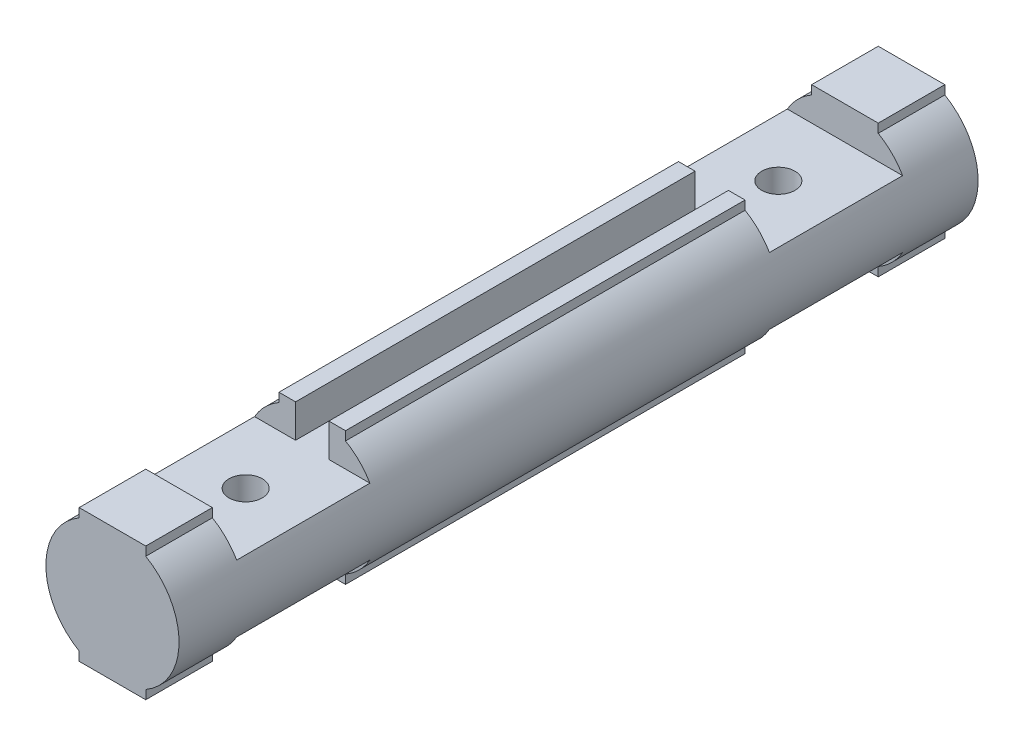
from build123d import *

# Parameters (mm, degrees)
SKETCH1_R               = 10
BOSS_EXTRUDE1_DEPTH     = 60
SKETCH2_W               = 10
SKETCH2_H               = 20
BOSS_EXTRUDE2_DEPTH     = 120
SKETCH3_W               = 17.320508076
SKETCH3_H               = 5
CUT_EXTRUDE1_DEPTH      = 10
SKETCH4_R               = 2.5
CUT_EXTRUDE3_DEPTH      = 63.649820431
SKETCH5_W               = 5
SKETCH5_H               = 60
CUT_EXTRUDE2_DEPTH      = 5
MIRROR2_COPY_1_SKETCH_W = 17.320508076
MIRROR2_COPY_1_SKETCH_H = 5
MIRROR2_COPY_1_DEPTH    = 10
MIRROR2_COPY_2_SKETCH_R = 2.5
MIRROR2_COPY_2_DEPTH    = 63.649820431
MIRROR2_COPY_3_SKETCH_R = 2.5
MIRROR2_COPY_3_DEPTH    = 63.649820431


with BuildPart() as part:
    # Sketch1 → Boss-Extrude1 (new, symmetric)
    with BuildSketch(Plane.XY):
        Circle(SKETCH1_R)
    extrude(amount=BOSS_EXTRUDE1_DEPTH, both=True)

    # Sketch2 → Boss-Extrude2 (add)
    with BuildSketch(Plane.XY.offset(60)):
        Rectangle(SKETCH2_W, SKETCH2_H)
    extrude(amount=-BOSS_EXTRUDE2_DEPTH)

    # Sketch3 → Cut-Extrude1 (cut, symmetric)
    with BuildSketch(Plane.XY.offset(-40)):
        with Locations((0, 7.5)):
            Rectangle(SKETCH3_W, SKETCH3_H)
    cut_extrude1 = extrude(amount=CUT_EXTRUDE1_DEPTH, both=True, mode=Mode.SUBTRACT)

    # Sketch4 → Cut-Extrude3 (cut, through all)
    with BuildSketch(Plane(origin=(0, 5, 0), x_dir=(1, 0, 0), z_dir=(0, 1, 0))):
        with Locations(Location((0, 40, 0), (0, 0, 270))):
            Circle(SKETCH4_R)
    cut_extrude3 = extrude(amount=-CUT_EXTRUDE3_DEPTH, mode=Mode.SUBTRACT)

    # Mirror1: Cut-Extrude1, Cut-Extrude3 across plane
    add(cut_extrude1.mirror(Plane.XY), mode=Mode.SUBTRACT)
    add(cut_extrude3.mirror(Plane.XY), mode=Mode.SUBTRACT)

    # Sketch5 → Cut-Extrude2 (cut)
    with BuildSketch(Plane(origin=(0, 10, 0), x_dir=(1, 0, 0), z_dir=(0, 1, 0))):
        Rectangle(SKETCH5_W, SKETCH5_H)
    cut_extrude2 = extrude(amount=-CUT_EXTRUDE2_DEPTH, mode=Mode.SUBTRACT)

    # Mirror2: Cut-Extrude1, Cut-Extrude2 across plane
    add(cut_extrude1.mirror(Plane.ZX), mode=Mode.SUBTRACT)
    add(cut_extrude2.mirror(Plane.ZX), mode=Mode.SUBTRACT)

    # Mirror2 copy 1 sketch → Mirror2 copy 1 (cut, symmetric)
    with BuildSketch(Plane(origin=(0, 0, 40), x_dir=(1, 0, 0), z_dir=(0, 0, -1))):
        with Locations((0, 7.5)):
            Rectangle(MIRROR2_COPY_1_SKETCH_W, MIRROR2_COPY_1_SKETCH_H)
    extrude(amount=MIRROR2_COPY_1_DEPTH, both=True, mode=Mode.SUBTRACT)

    # Mirror2 copy 2 sketch → Mirror2 copy 2 (cut, through all)
    with BuildSketch(Plane.XZ.offset(5)):
        with Locations(Location((0, 40, 0), (0, 0, 270))):
            Circle(MIRROR2_COPY_2_SKETCH_R)
    extrude(amount=-MIRROR2_COPY_2_DEPTH, mode=Mode.SUBTRACT)

    # Mirror2 copy 3 sketch → Mirror2 copy 3 (cut, through all)
    with BuildSketch(Plane.XZ.offset(5)):
        with Locations((0, -40)):
            Circle(MIRROR2_COPY_3_SKETCH_R)
    extrude(amount=-MIRROR2_COPY_3_DEPTH, mode=Mode.SUBTRACT)


solid = part.part
